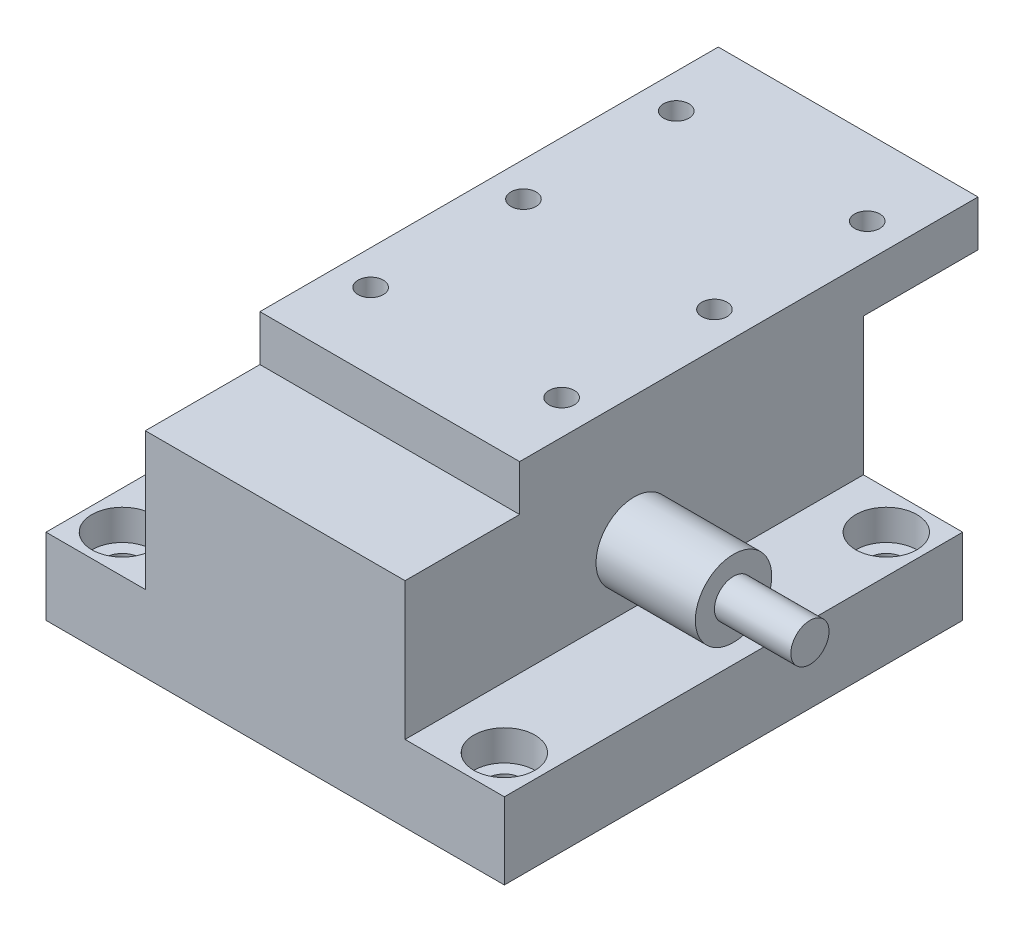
ISO-10303-21;
HEADER;
FILE_DESCRIPTION(('STEP AP214'),'2;1');
FILE_NAME('part.step','',(''),(''),'','','');
FILE_SCHEMA(('AUTOMOTIVE_DESIGN { 1 0 10303 214 1 1 1 1 }'));
ENDSEC;
DATA;
#1=APPLICATION_CONTEXT('core data for automotive mechanical design processes');
#2=APPLICATION_PROTOCOL_DEFINITION('international standard','automotive_design',2000,#1);
#3=PRODUCT_CONTEXT('',#1,'mechanical');
#4=PRODUCT('Part','Part','',(#3));
#5=PRODUCT_RELATED_PRODUCT_CATEGORY('part','',(#4));
#6=PRODUCT_DEFINITION_FORMATION('','',#4);
#7=PRODUCT_DEFINITION_CONTEXT('part definition',#1,'design');
#8=PRODUCT_DEFINITION('design','',#6,#7);
#9=PRODUCT_DEFINITION_SHAPE('','',#8);
#10=(LENGTH_UNIT() NAMED_UNIT(*) SI_UNIT(.MILLI.,.METRE.));
#11=(NAMED_UNIT(*) PLANE_ANGLE_UNIT() SI_UNIT($,.RADIAN.));
#12=(NAMED_UNIT(*) SI_UNIT($,.STERADIAN.) SOLID_ANGLE_UNIT());
#13=UNCERTAINTY_MEASURE_WITH_UNIT(LENGTH_MEASURE(1.E-05),#10,'distance_accuracy_value','');
#14=(GEOMETRIC_REPRESENTATION_CONTEXT(3) GLOBAL_UNCERTAINTY_ASSIGNED_CONTEXT((#13)) GLOBAL_UNIT_ASSIGNED_CONTEXT((#10,
#11,#12)) REPRESENTATION_CONTEXT('',''));
#15=CARTESIAN_POINT('',(0.,0.,0.));
#16=DIRECTION('',(0.,0.,1.));
#17=DIRECTION('',(1.,0.,0.));
#18=AXIS2_PLACEMENT_3D('',#15,#16,#17);
#19=CARTESIAN_POINT('',(30.,17.5,-30.));
#20=DIRECTION('',(1.,0.,0.));
#21=DIRECTION('',(0.,0.,-1.));
#22=AXIS2_PLACEMENT_3D('',#19,#20,#21);
#23=PLANE('',#22);
#24=CARTESIAN_POINT('',(30.,17.5,-30.));
#25=DIRECTION('',(1.,0.,0.));
#26=DIRECTION('',(0.,0.,-1.));
#27=AXIS2_PLACEMENT_3D('',#24,#25,#26);
#28=CIRCLE('',#27,5.);
#29=CARTESIAN_POINT('',(30.,17.5,-25.));
#30=VERTEX_POINT('',#29);
#31=EDGE_CURVE('E242',#30,#30,#28,.T.);
#32=ORIENTED_EDGE('',*,*,#31,.T.);
#33=EDGE_LOOP('',(#32));
#34=FACE_BOUND('',#33,.T.);
#35=CARTESIAN_POINT('',(30.,17.5,-30.));
#36=DIRECTION('',(1.,0.,0.));
#37=DIRECTION('',(0.,0.,-1.));
#38=AXIS2_PLACEMENT_3D('',#35,#36,#37);
#39=CIRCLE('',#38,2.5);
#40=CARTESIAN_POINT('',(30.,17.5,-32.5));
#41=VERTEX_POINT('',#40);
#42=EDGE_CURVE('E799',#41,#41,#39,.T.);
#43=ORIENTED_EDGE('',*,*,#42,.F.);
#44=EDGE_LOOP('',(#43));
#45=FACE_BOUND('',#44,.T.);
#46=ADVANCED_FACE('F34',(#34,#45),#23,.T.);
#47=CARTESIAN_POINT('',(0.,28.,0.));
#48=DIRECTION('',(0.,-1.,0.));
#49=DIRECTION('',(0.,0.,-1.));
#50=AXIS2_PLACEMENT_3D('',#47,#48,#49);
#51=PLANE('',#50);
#52=DIRECTION('',(1.,0.,0.));
#53=VECTOR('',#52,1.);
#54=CARTESIAN_POINT('',(-17.,28.,-15.));
#55=LINE('',#54,#53);
#56=CARTESIAN_POINT('',(-17.,28.,-15.));
#57=VERTEX_POINT('',#56);
#58=CARTESIAN_POINT('',(17.,28.,-15.));
#59=VERTEX_POINT('',#58);
#60=EDGE_CURVE('E51',#57,#59,#55,.T.);
#61=ORIENTED_EDGE('',*,*,#60,.F.);
#62=DIRECTION('',(0.,0.,1.));
#63=VECTOR('',#62,1.);
#64=CARTESIAN_POINT('',(-17.,28.,0.));
#65=LINE('',#64,#63);
#66=CARTESIAN_POINT('',(-17.,28.,0.));
#67=VERTEX_POINT('',#66);
#68=EDGE_CURVE('E250',#57,#67,#65,.T.);
#69=ORIENTED_EDGE('',*,*,#68,.T.);
#70=DIRECTION('',(1.,0.,0.));
#71=VECTOR('',#70,1.);
#72=CARTESIAN_POINT('',(-17.,28.,0.));
#73=LINE('',#72,#71);
#74=CARTESIAN_POINT('',(17.,28.,0.));
#75=VERTEX_POINT('',#74);
#76=EDGE_CURVE('E252',#67,#75,#73,.T.);
#77=ORIENTED_EDGE('',*,*,#76,.T.);
#78=DIRECTION('',(0.,0.,-1.));
#79=VECTOR('',#78,1.);
#80=CARTESIAN_POINT('',(17.,28.,0.));
#81=LINE('',#80,#79);
#82=EDGE_CURVE('E228',#75,#59,#81,.T.);
#83=ORIENTED_EDGE('',*,*,#82,.T.);
#84=EDGE_LOOP('',(#61,#69,#77,#83));
#85=FACE_BOUND('',#84,.T.);
#86=ADVANCED_FACE('F258',(#85),#51,.F.);
#87=CARTESIAN_POINT('',(17.,28.,0.));
#88=DIRECTION('',(-1.,0.,0.));
#89=DIRECTION('',(0.,0.,1.));
#90=AXIS2_PLACEMENT_3D('',#87,#88,#89);
#91=PLANE('',#90);
#92=DIRECTION('',(0.,0.,-1.));
#93=VECTOR('',#92,1.);
#94=CARTESIAN_POINT('',(17.,10.,0.));
#95=LINE('',#94,#93);
#96=CARTESIAN_POINT('',(17.,10.,0.));
#97=VERTEX_POINT('',#96);
#98=CARTESIAN_POINT('',(17.,10.,-60.));
#99=VERTEX_POINT('',#98);
#100=EDGE_CURVE('E241',#97,#99,#95,.T.);
#101=ORIENTED_EDGE('',*,*,#100,.T.);
#102=DIRECTION('',(0.,-1.,0.));
#103=VECTOR('',#102,1.);
#104=CARTESIAN_POINT('',(17.,28.,-60.));
#105=LINE('',#104,#103);
#106=CARTESIAN_POINT('',(17.,28.,-60.));
#107=VERTEX_POINT('',#106);
#108=EDGE_CURVE('E247',#107,#99,#105,.T.);
#109=ORIENTED_EDGE('',*,*,#108,.F.);
#110=DIRECTION('',(0.,0.,-1.));
#111=VECTOR('',#110,1.);
#112=CARTESIAN_POINT('',(17.,28.,-15.));
#113=LINE('',#112,#111);
#114=CARTESIAN_POINT('',(17.,28.,-75.));
#115=VERTEX_POINT('',#114);
#116=EDGE_CURVE('E192',#107,#115,#113,.T.);
#117=ORIENTED_EDGE('',*,*,#116,.T.);
#118=DIRECTION('',(0.,-1.,0.));
#119=VECTOR('',#118,1.);
#120=CARTESIAN_POINT('',(17.,34.,-75.));
#121=LINE('',#120,#119);
#122=CARTESIAN_POINT('',(17.,34.,-75.));
#123=VERTEX_POINT('',#122);
#124=EDGE_CURVE('E190',#123,#115,#121,.T.);
#125=ORIENTED_EDGE('',*,*,#124,.F.);
#126=DIRECTION('',(0.,0.,-1.));
#127=VECTOR('',#126,1.);
#128=CARTESIAN_POINT('',(17.,34.,-15.));
#129=LINE('',#128,#127);
#130=CARTESIAN_POINT('',(17.,34.,-15.));
#131=VERTEX_POINT('',#130);
#132=EDGE_CURVE('E177',#131,#123,#129,.T.);
#133=ORIENTED_EDGE('',*,*,#132,.F.);
#134=DIRECTION('',(0.,-1.,0.));
#135=VECTOR('',#134,1.);
#136=CARTESIAN_POINT('',(17.,34.,-15.));
#137=LINE('',#136,#135);
#138=EDGE_CURVE('E204',#131,#59,#137,.T.);
#139=ORIENTED_EDGE('',*,*,#138,.T.);
#140=ORIENTED_EDGE('',*,*,#82,.F.);
#141=DIRECTION('',(0.,-1.,0.));
#142=VECTOR('',#141,1.);
#143=CARTESIAN_POINT('',(17.,28.,0.));
#144=LINE('',#143,#142);
#145=EDGE_CURVE('E270',#75,#97,#144,.T.);
#146=ORIENTED_EDGE('',*,*,#145,.T.);
#147=EDGE_LOOP('',(#101,#109,#117,#125,#133,#139,#140,#146));
#148=FACE_BOUND('',#147,.T.);
#149=CARTESIAN_POINT('',(17.,17.5,-30.));
#150=DIRECTION('',(-1.,0.,0.));
#151=DIRECTION('',(0.,0.,1.));
#152=AXIS2_PLACEMENT_3D('',#149,#150,#151);
#153=CIRCLE('',#152,5.);
#154=CARTESIAN_POINT('',(17.,17.5,-25.));
#155=VERTEX_POINT('',#154);
#156=EDGE_CURVE('E11',#155,#155,#153,.F.);
#157=ORIENTED_EDGE('',*,*,#156,.F.);
#158=EDGE_LOOP('',(#157));
#159=FACE_BOUND('',#158,.T.);
#160=ADVANCED_FACE('F340',(#148,#159),#91,.F.);
#161=CARTESIAN_POINT('',(30.,10.,0.));
#162=DIRECTION('',(0.,-1.,0.));
#163=DIRECTION('',(0.,0.,-1.));
#164=AXIS2_PLACEMENT_3D('',#161,#162,#163);
#165=PLANE('',#164);
#166=CARTESIAN_POINT('',(-25.,10.,-55.));
#167=DIRECTION('',(0.,1.,0.));
#168=DIRECTION('',(0.,0.,1.));
#169=AXIS2_PLACEMENT_3D('',#166,#167,#168);
#170=CIRCLE('',#169,3.99999999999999);
#171=CARTESIAN_POINT('',(-25.,10.,-51.));
#172=VERTEX_POINT('',#171);
#173=EDGE_CURVE('E194',#172,#172,#170,.T.);
#174=ORIENTED_EDGE('',*,*,#173,.F.);
#175=EDGE_LOOP('',(#174));
#176=FACE_BOUND('',#175,.T.);
#177=CARTESIAN_POINT('',(-25.,10.,-5.));
#178=DIRECTION('',(0.,1.,0.));
#179=DIRECTION('',(0.,0.,1.));
#180=AXIS2_PLACEMENT_3D('',#177,#178,#179);
#181=CIRCLE('',#180,3.99999999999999);
#182=CARTESIAN_POINT('',(-25.,10.,-1.00000000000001));
#183=VERTEX_POINT('',#182);
#184=EDGE_CURVE('E437',#183,#183,#181,.T.);
#185=ORIENTED_EDGE('',*,*,#184,.F.);
#186=EDGE_LOOP('',(#185));
#187=FACE_BOUND('',#186,.T.);
#188=DIRECTION('',(0.,0.,1.));
#189=VECTOR('',#188,1.);
#190=CARTESIAN_POINT('',(-17.,10.,0.));
#191=LINE('',#190,#189);
#192=CARTESIAN_POINT('',(-17.,10.,-60.));
#193=VERTEX_POINT('',#192);
#194=CARTESIAN_POINT('',(-17.,10.,0.));
#195=VERTEX_POINT('',#194);
#196=EDGE_CURVE('E59',#193,#195,#191,.T.);
#197=ORIENTED_EDGE('',*,*,#196,.F.);
#198=DIRECTION('',(-1.,0.,0.));
#199=VECTOR('',#198,1.);
#200=CARTESIAN_POINT('',(30.,10.,-60.));
#201=LINE('',#200,#199);
#202=CARTESIAN_POINT('',(-30.,10.,-60.));
#203=VERTEX_POINT('',#202);
#204=EDGE_CURVE('E285',#193,#203,#201,.T.);
#205=ORIENTED_EDGE('',*,*,#204,.T.);
#206=DIRECTION('',(0.,0.,1.));
#207=VECTOR('',#206,1.);
#208=CARTESIAN_POINT('',(-30.,10.,0.));
#209=LINE('',#208,#207);
#210=CARTESIAN_POINT('',(-30.,10.,0.));
#211=VERTEX_POINT('',#210);
#212=EDGE_CURVE('E318',#203,#211,#209,.T.);
#213=ORIENTED_EDGE('',*,*,#212,.T.);
#214=DIRECTION('',(-1.,0.,0.));
#215=VECTOR('',#214,1.);
#216=CARTESIAN_POINT('',(30.,10.,0.));
#217=LINE('',#216,#215);
#218=EDGE_CURVE('E301',#195,#211,#217,.T.);
#219=ORIENTED_EDGE('',*,*,#218,.F.);
#220=EDGE_LOOP('',(#197,#205,#213,#219));
#221=FACE_BOUND('',#220,.T.);
#222=ADVANCED_FACE('F378',(#176,#187,#221),#165,.F.);
#223=CARTESIAN_POINT('',(25.,10.,-5.));
#224=DIRECTION('',(0.,1.,0.));
#225=DIRECTION('',(0.,0.,1.));
#226=AXIS2_PLACEMENT_3D('',#223,#224,#225);
#227=CIRCLE('',#226,3.99999999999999);
#228=CARTESIAN_POINT('',(25.,10.,-1.00000000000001));
#229=VERTEX_POINT('',#228);
#230=EDGE_CURVE('E427',#229,#229,#227,.T.);
#231=ORIENTED_EDGE('',*,*,#230,.F.);
#232=EDGE_LOOP('',(#231));
#233=FACE_BOUND('',#232,.T.);
#234=CARTESIAN_POINT('',(25.,10.,-55.));
#235=DIRECTION('',(0.,1.,0.));
#236=DIRECTION('',(0.,0.,1.));
#237=AXIS2_PLACEMENT_3D('',#234,#235,#236);
#238=CIRCLE('',#237,3.99999999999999);
#239=CARTESIAN_POINT('',(25.,10.,-51.));
#240=VERTEX_POINT('',#239);
#241=EDGE_CURVE('E417',#240,#240,#238,.T.);
#242=ORIENTED_EDGE('',*,*,#241,.F.);
#243=EDGE_LOOP('',(#242));
#244=FACE_BOUND('',#243,.T.);
#245=ORIENTED_EDGE('',*,*,#100,.F.);
#246=CARTESIAN_POINT('',(30.,10.,0.));
#247=VERTEX_POINT('',#246);
#248=EDGE_CURVE('E273',#247,#97,#217,.T.);
#249=ORIENTED_EDGE('',*,*,#248,.F.);
#250=DIRECTION('',(0.,0.,1.));
#251=VECTOR('',#250,1.);
#252=CARTESIAN_POINT('',(30.,10.,0.));
#253=LINE('',#252,#251);
#254=CARTESIAN_POINT('',(30.,10.,-60.));
#255=VERTEX_POINT('',#254);
#256=EDGE_CURVE('E302',#255,#247,#253,.T.);
#257=ORIENTED_EDGE('',*,*,#256,.F.);
#258=EDGE_CURVE('E288',#255,#99,#201,.T.);
#259=ORIENTED_EDGE('',*,*,#258,.T.);
#260=EDGE_LOOP('',(#245,#249,#257,#259));
#261=FACE_BOUND('',#260,.T.);
#262=ADVANCED_FACE('F334',(#233,#244,#261),#165,.F.);
#263=CARTESIAN_POINT('',(30.,0.,0.));
#264=DIRECTION('',(0.,0.,-1.));
#265=DIRECTION('',(-1.,0.,0.));
#266=AXIS2_PLACEMENT_3D('',#263,#264,#265);
#267=PLANE('',#266);
#268=DIRECTION('',(0.,-1.,0.));
#269=VECTOR('',#268,1.);
#270=CARTESIAN_POINT('',(-30.,0.,0.));
#271=LINE('',#270,#269);
#272=CARTESIAN_POINT('',(-30.,0.,0.));
#273=VERTEX_POINT('',#272);
#274=EDGE_CURVE('E276',#211,#273,#271,.T.);
#275=ORIENTED_EDGE('',*,*,#274,.T.);
#276=DIRECTION('',(-1.,0.,0.));
#277=VECTOR('',#276,1.);
#278=CARTESIAN_POINT('',(30.,0.,0.));
#279=LINE('',#278,#277);
#280=CARTESIAN_POINT('',(30.,0.,0.));
#281=VERTEX_POINT('',#280);
#282=EDGE_CURVE('E43',#281,#273,#279,.T.);
#283=ORIENTED_EDGE('',*,*,#282,.F.);
#284=DIRECTION('',(0.,-1.,0.));
#285=VECTOR('',#284,1.);
#286=CARTESIAN_POINT('',(30.,0.,0.));
#287=LINE('',#286,#285);
#288=EDGE_CURVE('E319',#247,#281,#287,.T.);
#289=ORIENTED_EDGE('',*,*,#288,.F.);
#290=ORIENTED_EDGE('',*,*,#248,.T.);
#291=ORIENTED_EDGE('',*,*,#145,.F.);
#292=ORIENTED_EDGE('',*,*,#76,.F.);
#293=DIRECTION('',(0.,-1.,0.));
#294=VECTOR('',#293,1.);
#295=CARTESIAN_POINT('',(-17.,28.,0.));
#296=LINE('',#295,#294);
#297=EDGE_CURVE('E266',#67,#195,#296,.T.);
#298=ORIENTED_EDGE('',*,*,#297,.T.);
#299=ORIENTED_EDGE('',*,*,#218,.T.);
#300=EDGE_LOOP('',(#275,#283,#289,#290,#291,#292,#298,#299));
#301=FACE_BOUND('',#300,.T.);
#302=ADVANCED_FACE('F36',(#301),#267,.F.);
#303=CARTESIAN_POINT('',(30.,0.,0.));
#304=DIRECTION('',(0.,1.,0.));
#305=DIRECTION('',(0.,0.,1.));
#306=AXIS2_PLACEMENT_3D('',#303,#304,#305);
#307=PLANE('',#306);
#308=CARTESIAN_POINT('',(-25.,0.,-55.));
#309=DIRECTION('',(0.,1.,0.));
#310=DIRECTION('',(0.,0.,1.));
#311=AXIS2_PLACEMENT_3D('',#308,#309,#310);
#312=CIRCLE('',#311,2.25);
#313=CARTESIAN_POINT('',(-25.,0.,-52.75));
#314=VERTEX_POINT('',#313);
#315=EDGE_CURVE('E397',#314,#314,#312,.T.);
#316=ORIENTED_EDGE('',*,*,#315,.T.);
#317=EDGE_LOOP('',(#316));
#318=FACE_BOUND('',#317,.T.);
#319=CARTESIAN_POINT('',(-25.,0.,-5.));
#320=DIRECTION('',(0.,1.,0.));
#321=DIRECTION('',(0.,0.,1.));
#322=AXIS2_PLACEMENT_3D('',#319,#320,#321);
#323=CIRCLE('',#322,2.25);
#324=CARTESIAN_POINT('',(-25.,0.,-2.75));
#325=VERTEX_POINT('',#324);
#326=EDGE_CURVE('E401',#325,#325,#323,.T.);
#327=ORIENTED_EDGE('',*,*,#326,.T.);
#328=EDGE_LOOP('',(#327));
#329=FACE_BOUND('',#328,.T.);
#330=CARTESIAN_POINT('',(25.,0.,-5.));
#331=DIRECTION('',(0.,1.,0.));
#332=DIRECTION('',(0.,0.,1.));
#333=AXIS2_PLACEMENT_3D('',#330,#331,#332);
#334=CIRCLE('',#333,2.25);
#335=CARTESIAN_POINT('',(25.,0.,-2.75));
#336=VERTEX_POINT('',#335);
#337=EDGE_CURVE('E405',#336,#336,#334,.T.);
#338=ORIENTED_EDGE('',*,*,#337,.T.);
#339=EDGE_LOOP('',(#338));
#340=FACE_BOUND('',#339,.T.);
#341=CARTESIAN_POINT('',(25.,0.,-55.));
#342=DIRECTION('',(0.,1.,0.));
#343=DIRECTION('',(0.,0.,1.));
#344=AXIS2_PLACEMENT_3D('',#341,#342,#343);
#345=CIRCLE('',#344,2.25);
#346=CARTESIAN_POINT('',(25.,0.,-52.75));
#347=VERTEX_POINT('',#346);
#348=EDGE_CURVE('E408',#347,#347,#345,.T.);
#349=ORIENTED_EDGE('',*,*,#348,.T.);
#350=EDGE_LOOP('',(#349));
#351=FACE_BOUND('',#350,.T.);
#352=DIRECTION('',(0.,0.,-1.));
#353=VECTOR('',#352,1.);
#354=CARTESIAN_POINT('',(-30.,0.,0.));
#355=LINE('',#354,#353);
#356=CARTESIAN_POINT('',(-30.,0.,-60.));
#357=VERTEX_POINT('',#356);
#358=EDGE_CURVE('E314',#273,#357,#355,.T.);
#359=ORIENTED_EDGE('',*,*,#358,.T.);
#360=DIRECTION('',(-1.,0.,0.));
#361=VECTOR('',#360,1.);
#362=CARTESIAN_POINT('',(30.,0.,-60.));
#363=LINE('',#362,#361);
#364=CARTESIAN_POINT('',(30.,0.,-60.));
#365=VERTEX_POINT('',#364);
#366=EDGE_CURVE('E295',#365,#357,#363,.T.);
#367=ORIENTED_EDGE('',*,*,#366,.F.);
#368=DIRECTION('',(0.,0.,-1.));
#369=VECTOR('',#368,1.);
#370=CARTESIAN_POINT('',(30.,0.,0.));
#371=LINE('',#370,#369);
#372=EDGE_CURVE('E309',#281,#365,#371,.T.);
#373=ORIENTED_EDGE('',*,*,#372,.F.);
#374=ORIENTED_EDGE('',*,*,#282,.T.);
#375=EDGE_LOOP('',(#359,#367,#373,#374));
#376=FACE_BOUND('',#375,.T.);
#377=ADVANCED_FACE('F328',(#318,#329,#340,#351,#376),#307,.F.);
#378=CARTESIAN_POINT('',(30.,0.,-60.));
#379=DIRECTION('',(0.,0.,1.));
#380=DIRECTION('',(1.,0.,0.));
#381=AXIS2_PLACEMENT_3D('',#378,#379,#380);
#382=PLANE('',#381);
#383=DIRECTION('',(0.,1.,0.));
#384=VECTOR('',#383,1.);
#385=CARTESIAN_POINT('',(-30.,0.,-60.));
#386=LINE('',#385,#384);
#387=EDGE_CURVE('E316',#357,#203,#386,.T.);
#388=ORIENTED_EDGE('',*,*,#387,.T.);
#389=ORIENTED_EDGE('',*,*,#204,.F.);
#390=DIRECTION('',(0.,-1.,0.));
#391=VECTOR('',#390,1.);
#392=CARTESIAN_POINT('',(-17.,28.,-60.));
#393=LINE('',#392,#391);
#394=CARTESIAN_POINT('',(-17.,28.,-60.));
#395=VERTEX_POINT('',#394);
#396=EDGE_CURVE('E227',#395,#193,#393,.T.);
#397=ORIENTED_EDGE('',*,*,#396,.F.);
#398=DIRECTION('',(-1.,0.,0.));
#399=VECTOR('',#398,1.);
#400=CARTESIAN_POINT('',(-17.,28.,-60.));
#401=LINE('',#400,#399);
#402=EDGE_CURVE('E224',#107,#395,#401,.T.);
#403=ORIENTED_EDGE('',*,*,#402,.F.);
#404=ORIENTED_EDGE('',*,*,#108,.T.);
#405=ORIENTED_EDGE('',*,*,#258,.F.);
#406=DIRECTION('',(0.,1.,0.));
#407=VECTOR('',#406,1.);
#408=CARTESIAN_POINT('',(30.,0.,-60.));
#409=LINE('',#408,#407);
#410=EDGE_CURVE('E304',#365,#255,#409,.T.);
#411=ORIENTED_EDGE('',*,*,#410,.F.);
#412=ORIENTED_EDGE('',*,*,#366,.T.);
#413=EDGE_LOOP('',(#388,#389,#397,#403,#404,#405,#411,#412));
#414=FACE_BOUND('',#413,.T.);
#415=ADVANCED_FACE('F331',(#414),#382,.F.);
#416=CARTESIAN_POINT('',(30.,0.,0.));
#417=DIRECTION('',(-1.,0.,0.));
#418=DIRECTION('',(0.,0.,1.));
#419=AXIS2_PLACEMENT_3D('',#416,#417,#418);
#420=PLANE('',#419);
#421=ORIENTED_EDGE('',*,*,#288,.T.);
#422=ORIENTED_EDGE('',*,*,#372,.T.);
#423=ORIENTED_EDGE('',*,*,#410,.T.);
#424=ORIENTED_EDGE('',*,*,#256,.T.);
#425=EDGE_LOOP('',(#421,#422,#423,#424));
#426=FACE_BOUND('',#425,.T.);
#427=ADVANCED_FACE('F324',(#426),#420,.F.);
#428=CARTESIAN_POINT('',(-30.,0.,0.));
#429=DIRECTION('',(-1.,0.,0.));
#430=DIRECTION('',(0.,0.,1.));
#431=AXIS2_PLACEMENT_3D('',#428,#429,#430);
#432=PLANE('',#431);
#433=ORIENTED_EDGE('',*,*,#274,.F.);
#434=ORIENTED_EDGE('',*,*,#212,.F.);
#435=ORIENTED_EDGE('',*,*,#387,.F.);
#436=ORIENTED_EDGE('',*,*,#358,.F.);
#437=EDGE_LOOP('',(#433,#434,#435,#436));
#438=FACE_BOUND('',#437,.T.);
#439=ADVANCED_FACE('F336',(#438),#432,.T.);
#440=CARTESIAN_POINT('',(-17.,28.,0.));
#441=DIRECTION('',(1.,0.,0.));
#442=DIRECTION('',(0.,0.,-1.));
#443=AXIS2_PLACEMENT_3D('',#440,#441,#442);
#444=PLANE('',#443);
#445=ORIENTED_EDGE('',*,*,#196,.T.);
#446=ORIENTED_EDGE('',*,*,#297,.F.);
#447=ORIENTED_EDGE('',*,*,#68,.F.);
#448=DIRECTION('',(0.,-1.,0.));
#449=VECTOR('',#448,1.);
#450=CARTESIAN_POINT('',(-17.,34.,-15.));
#451=LINE('',#450,#449);
#452=CARTESIAN_POINT('',(-17.,34.,-15.));
#453=VERTEX_POINT('',#452);
#454=EDGE_CURVE('E210',#453,#57,#451,.T.);
#455=ORIENTED_EDGE('',*,*,#454,.F.);
#456=DIRECTION('',(0.,0.,1.));
#457=VECTOR('',#456,1.);
#458=CARTESIAN_POINT('',(-17.,34.,-15.));
#459=LINE('',#458,#457);
#460=CARTESIAN_POINT('',(-17.,34.,-75.));
#461=VERTEX_POINT('',#460);
#462=EDGE_CURVE('E171',#461,#453,#459,.T.);
#463=ORIENTED_EDGE('',*,*,#462,.F.);
#464=DIRECTION('',(0.,-1.,0.));
#465=VECTOR('',#464,1.);
#466=CARTESIAN_POINT('',(-17.,34.,-75.));
#467=LINE('',#466,#465);
#468=CARTESIAN_POINT('',(-17.,28.,-75.));
#469=VERTEX_POINT('',#468);
#470=EDGE_CURVE('E181',#461,#469,#467,.T.);
#471=ORIENTED_EDGE('',*,*,#470,.T.);
#472=DIRECTION('',(0.,0.,1.));
#473=VECTOR('',#472,1.);
#474=CARTESIAN_POINT('',(-17.,28.,-15.));
#475=LINE('',#474,#473);
#476=EDGE_CURVE('E170',#469,#395,#475,.T.);
#477=ORIENTED_EDGE('',*,*,#476,.T.);
#478=ORIENTED_EDGE('',*,*,#396,.T.);
#479=EDGE_LOOP('',(#445,#446,#447,#455,#463,#471,#477,#478));
#480=FACE_BOUND('',#479,.T.);
#481=ADVANCED_FACE('F263',(#480),#444,.F.);
#482=CARTESIAN_POINT('',(30.,17.5,-30.));
#483=DIRECTION('',(-1.,0.,0.));
#484=DIRECTION('',(0.,0.,1.));
#485=AXIS2_PLACEMENT_3D('',#482,#483,#484);
#486=CYLINDRICAL_SURFACE('',#485,5.);
#487=CARTESIAN_POINT('',(30.,17.5,-25.));
#488=CARTESIAN_POINT('',(29.8645833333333,17.5,-25.));
#489=CARTESIAN_POINT('',(29.7291666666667,17.5,-25.));
#490=CARTESIAN_POINT('',(29.4583333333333,17.5,-25.));
#491=CARTESIAN_POINT('',(29.3229166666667,17.5,-25.));
#492=CARTESIAN_POINT('',(29.0520833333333,17.5,-25.));
#493=CARTESIAN_POINT('',(28.9166666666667,17.5,-25.));
#494=CARTESIAN_POINT('',(28.6458333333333,17.5,-25.));
#495=CARTESIAN_POINT('',(28.5104166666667,17.5,-25.));
#496=CARTESIAN_POINT('',(28.2395833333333,17.5,-25.));
#497=CARTESIAN_POINT('',(28.1041666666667,17.5,-25.));
#498=CARTESIAN_POINT('',(27.8333333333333,17.5,-25.));
#499=CARTESIAN_POINT('',(27.6979166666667,17.5,-25.));
#500=CARTESIAN_POINT('',(27.4270833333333,17.5,-25.));
#501=CARTESIAN_POINT('',(27.2916666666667,17.5,-25.));
#502=CARTESIAN_POINT('',(27.0208333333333,17.5,-25.));
#503=CARTESIAN_POINT('',(26.8854166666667,17.5,-25.));
#504=CARTESIAN_POINT('',(26.6145833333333,17.5,-25.));
#505=CARTESIAN_POINT('',(26.4791666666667,17.5,-25.));
#506=CARTESIAN_POINT('',(26.2083333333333,17.5,-25.));
#507=CARTESIAN_POINT('',(26.0729166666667,17.5,-25.));
#508=CARTESIAN_POINT('',(25.8020833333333,17.5,-25.));
#509=CARTESIAN_POINT('',(25.6666666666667,17.5,-25.));
#510=CARTESIAN_POINT('',(25.3958333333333,17.5,-25.));
#511=CARTESIAN_POINT('',(25.2604166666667,17.5,-25.));
#512=CARTESIAN_POINT('',(24.9895833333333,17.5,-25.));
#513=CARTESIAN_POINT('',(24.8541666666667,17.5,-25.));
#514=CARTESIAN_POINT('',(24.5833333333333,17.5,-25.));
#515=CARTESIAN_POINT('',(24.4479166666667,17.5,-25.));
#516=CARTESIAN_POINT('',(24.1770833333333,17.5,-25.));
#517=CARTESIAN_POINT('',(24.0416666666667,17.5,-25.));
#518=CARTESIAN_POINT('',(23.7708333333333,17.5,-25.));
#519=CARTESIAN_POINT('',(23.6354166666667,17.5,-25.));
#520=CARTESIAN_POINT('',(23.3645833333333,17.5,-25.));
#521=CARTESIAN_POINT('',(23.2291666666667,17.5,-25.));
#522=CARTESIAN_POINT('',(22.9583333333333,17.5,-25.));
#523=CARTESIAN_POINT('',(22.8229166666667,17.5,-25.));
#524=CARTESIAN_POINT('',(22.5520833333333,17.5,-25.));
#525=CARTESIAN_POINT('',(22.4166666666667,17.5,-25.));
#526=CARTESIAN_POINT('',(22.1458333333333,17.5,-25.));
#527=CARTESIAN_POINT('',(22.0104166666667,17.5,-25.));
#528=CARTESIAN_POINT('',(21.7395833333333,17.5,-25.));
#529=CARTESIAN_POINT('',(21.6041666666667,17.5,-25.));
#530=CARTESIAN_POINT('',(21.3333333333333,17.5,-25.));
#531=CARTESIAN_POINT('',(21.1979166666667,17.5,-25.));
#532=CARTESIAN_POINT('',(20.9270833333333,17.5,-25.));
#533=CARTESIAN_POINT('',(20.7916666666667,17.5,-25.));
#534=CARTESIAN_POINT('',(20.5208333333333,17.5,-25.));
#535=CARTESIAN_POINT('',(20.3854166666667,17.5,-25.));
#536=CARTESIAN_POINT('',(20.1145833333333,17.5,-25.));
#537=CARTESIAN_POINT('',(19.9791666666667,17.5,-25.));
#538=CARTESIAN_POINT('',(19.7083333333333,17.5,-25.));
#539=CARTESIAN_POINT('',(19.5729166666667,17.5,-25.));
#540=CARTESIAN_POINT('',(19.3020833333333,17.5,-25.));
#541=CARTESIAN_POINT('',(19.1666666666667,17.5,-25.));
#542=CARTESIAN_POINT('',(18.8958333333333,17.5,-25.));
#543=CARTESIAN_POINT('',(18.7604166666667,17.5,-25.));
#544=CARTESIAN_POINT('',(18.4895833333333,17.5,-25.));
#545=CARTESIAN_POINT('',(18.3541666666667,17.5,-25.));
#546=CARTESIAN_POINT('',(18.0833333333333,17.5,-25.));
#547=CARTESIAN_POINT('',(17.9479166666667,17.5,-25.));
#548=CARTESIAN_POINT('',(17.6770833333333,17.5,-25.));
#549=CARTESIAN_POINT('',(17.5416666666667,17.5,-25.));
#550=CARTESIAN_POINT('',(17.2708333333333,17.5,-25.));
#551=CARTESIAN_POINT('',(17.1354166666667,17.5,-25.));
#552=CARTESIAN_POINT('',(17.,17.5,-25.));
#553=B_SPLINE_CURVE_WITH_KNOTS('',3,(#487,#488,#489,#490,#491,#492,#493,#494,#495,#496,#497,
#498,#499,#500,#501,#502,#503,#504,#505,#506,#507,#508,#509,#510,#511,#512,#513,#514,#515,#516,
#517,#518,#519,#520,#521,#522,#523,#524,#525,#526,#527,#528,#529,#530,#531,#532,#533,#534,#535,
#536,#537,#538,#539,#540,#541,#542,#543,#544,#545,#546,#547,#548,#549,#550,#551,#552),
.UNSPECIFIED.,.F.,.F.,(4,2,2,2,2,2,2,2,2,2,2,2,2,2,2,2,2,2,2,2,2,2,2,2,2,2,2,2,2,2,2,2,4),(0.,
0.40625,0.812500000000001,1.21875,1.625,2.03125,2.4375,2.84375,3.25,3.65625,4.0625,4.46875,
4.875,5.28125,5.6875,6.09375,6.5,6.90625,7.3125,7.71875,8.125,8.53125,8.9375,9.34375,
9.74999999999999,10.15625,10.5625,10.96875,11.375,11.78125,12.1875,12.59375,13.),.UNSPECIFIED.);
#554=EDGE_CURVE('BSEAM372',#30,#155,#553,.T.);
#555=ORIENTED_EDGE('',*,*,#31,.F.);
#556=ORIENTED_EDGE('',*,*,#156,.T.);
#557=ORIENTED_EDGE('',*,*,#554,.T.);
#558=ORIENTED_EDGE('',*,*,#554,.F.);
#559=EDGE_LOOP('',(#555,#557,#556,#558));
#560=FACE_BOUND('',#559,.T.);
#561=ADVANCED_FACE('F372',(#560),#486,.T.);
#562=CARTESIAN_POINT('',(25.,10.,-55.));
#563=DIRECTION('',(0.,1.,0.));
#564=DIRECTION('',(0.,0.,1.));
#565=AXIS2_PLACEMENT_3D('',#562,#563,#564);
#566=CYLINDRICAL_SURFACE('',#565,2.25);
#567=ORIENTED_EDGE('',*,*,#348,.F.);
#568=EDGE_LOOP('',(#567));
#569=FACE_BOUND('',#568,.T.);
#570=CARTESIAN_POINT('',(25.,6.,-55.));
#571=DIRECTION('',(0.,1.,0.));
#572=DIRECTION('',(0.,0.,1.));
#573=AXIS2_PLACEMENT_3D('',#570,#571,#572);
#574=CIRCLE('',#573,2.25);
#575=CARTESIAN_POINT('',(25.,6.,-52.75));
#576=VERTEX_POINT('',#575);
#577=EDGE_CURVE('E410',#576,#576,#574,.T.);
#578=ORIENTED_EDGE('',*,*,#577,.T.);
#579=EDGE_LOOP('',(#578));
#580=FACE_BOUND('',#579,.T.);
#581=ADVANCED_FACE('F370',(#569,#580),#566,.F.);
#582=CARTESIAN_POINT('',(27.25,6.,-55.));
#583=DIRECTION('',(0.,-1.,0.));
#584=DIRECTION('',(0.,0.,-1.));
#585=AXIS2_PLACEMENT_3D('',#582,#583,#584);
#586=PLANE('',#585);
#587=ORIENTED_EDGE('',*,*,#577,.F.);
#588=EDGE_LOOP('',(#587));
#589=FACE_BOUND('',#588,.T.);
#590=CARTESIAN_POINT('',(25.,6.,-55.));
#591=DIRECTION('',(0.,1.,0.));
#592=DIRECTION('',(0.,0.,1.));
#593=AXIS2_PLACEMENT_3D('',#590,#591,#592);
#594=CIRCLE('',#593,4.);
#595=CARTESIAN_POINT('',(25.,6.,-51.));
#596=VERTEX_POINT('',#595);
#597=EDGE_CURVE('E412',#596,#596,#594,.T.);
#598=ORIENTED_EDGE('',*,*,#597,.T.);
#599=EDGE_LOOP('',(#598));
#600=FACE_BOUND('',#599,.T.);
#601=ADVANCED_FACE('F490',(#589,#600),#586,.F.);
#602=CARTESIAN_POINT('',(25.,10.,-55.));
#603=DIRECTION('',(0.,1.,0.));
#604=DIRECTION('',(0.,0.,1.));
#605=AXIS2_PLACEMENT_3D('',#602,#603,#604);
#606=CYLINDRICAL_SURFACE('',#605,3.99999999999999);
#607=ORIENTED_EDGE('',*,*,#597,.F.);
#608=EDGE_LOOP('',(#607));
#609=FACE_BOUND('',#608,.T.);
#610=ORIENTED_EDGE('',*,*,#241,.T.);
#611=EDGE_LOOP('',(#610));
#612=FACE_BOUND('',#611,.T.);
#613=ADVANCED_FACE('F487',(#609,#612),#606,.F.);
#614=CARTESIAN_POINT('',(25.,10.,-5.));
#615=DIRECTION('',(0.,1.,0.));
#616=DIRECTION('',(0.,0.,1.));
#617=AXIS2_PLACEMENT_3D('',#614,#615,#616);
#618=CYLINDRICAL_SURFACE('',#617,2.25);
#619=ORIENTED_EDGE('',*,*,#337,.F.);
#620=EDGE_LOOP('',(#619));
#621=FACE_BOUND('',#620,.T.);
#622=CARTESIAN_POINT('',(25.,6.,-5.));
#623=DIRECTION('',(0.,1.,0.));
#624=DIRECTION('',(0.,0.,1.));
#625=AXIS2_PLACEMENT_3D('',#622,#623,#624);
#626=CIRCLE('',#625,2.25);
#627=CARTESIAN_POINT('',(25.,6.,-2.75));
#628=VERTEX_POINT('',#627);
#629=EDGE_CURVE('E421',#628,#628,#626,.T.);
#630=ORIENTED_EDGE('',*,*,#629,.T.);
#631=EDGE_LOOP('',(#630));
#632=FACE_BOUND('',#631,.T.);
#633=ADVANCED_FACE('F483',(#621,#632),#618,.F.);
#634=CARTESIAN_POINT('',(27.25,6.,-5.));
#635=DIRECTION('',(0.,-1.,0.));
#636=DIRECTION('',(0.,0.,-1.));
#637=AXIS2_PLACEMENT_3D('',#634,#635,#636);
#638=PLANE('',#637);
#639=ORIENTED_EDGE('',*,*,#629,.F.);
#640=EDGE_LOOP('',(#639));
#641=FACE_BOUND('',#640,.T.);
#642=CARTESIAN_POINT('',(25.,6.,-5.));
#643=DIRECTION('',(0.,1.,0.));
#644=DIRECTION('',(0.,0.,1.));
#645=AXIS2_PLACEMENT_3D('',#642,#643,#644);
#646=CIRCLE('',#645,4.);
#647=CARTESIAN_POINT('',(25.,6.,-1.));
#648=VERTEX_POINT('',#647);
#649=EDGE_CURVE('E424',#648,#648,#646,.T.);
#650=ORIENTED_EDGE('',*,*,#649,.T.);
#651=EDGE_LOOP('',(#650));
#652=FACE_BOUND('',#651,.T.);
#653=ADVANCED_FACE('F479',(#641,#652),#638,.F.);
#654=CARTESIAN_POINT('',(25.,10.,-5.));
#655=DIRECTION('',(0.,1.,0.));
#656=DIRECTION('',(0.,0.,1.));
#657=AXIS2_PLACEMENT_3D('',#654,#655,#656);
#658=CYLINDRICAL_SURFACE('',#657,3.99999999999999);
#659=ORIENTED_EDGE('',*,*,#649,.F.);
#660=EDGE_LOOP('',(#659));
#661=FACE_BOUND('',#660,.T.);
#662=ORIENTED_EDGE('',*,*,#230,.T.);
#663=EDGE_LOOP('',(#662));
#664=FACE_BOUND('',#663,.T.);
#665=ADVANCED_FACE('F475',(#661,#664),#658,.F.);
#666=CARTESIAN_POINT('',(-25.,10.,-5.));
#667=DIRECTION('',(0.,1.,0.));
#668=DIRECTION('',(0.,0.,1.));
#669=AXIS2_PLACEMENT_3D('',#666,#667,#668);
#670=CYLINDRICAL_SURFACE('',#669,2.25);
#671=ORIENTED_EDGE('',*,*,#326,.F.);
#672=EDGE_LOOP('',(#671));
#673=FACE_BOUND('',#672,.T.);
#674=CARTESIAN_POINT('',(-25.,6.,-5.));
#675=DIRECTION('',(0.,1.,0.));
#676=DIRECTION('',(0.,0.,1.));
#677=AXIS2_PLACEMENT_3D('',#674,#675,#676);
#678=CIRCLE('',#677,2.25);
#679=CARTESIAN_POINT('',(-25.,6.,-2.75));
#680=VERTEX_POINT('',#679);
#681=EDGE_CURVE('E431',#680,#680,#678,.T.);
#682=ORIENTED_EDGE('',*,*,#681,.T.);
#683=EDGE_LOOP('',(#682));
#684=FACE_BOUND('',#683,.T.);
#685=ADVANCED_FACE('F467',(#673,#684),#670,.F.);
#686=CARTESIAN_POINT('',(-22.75,6.,-5.));
#687=DIRECTION('',(0.,-1.,0.));
#688=DIRECTION('',(0.,0.,-1.));
#689=AXIS2_PLACEMENT_3D('',#686,#687,#688);
#690=PLANE('',#689);
#691=ORIENTED_EDGE('',*,*,#681,.F.);
#692=EDGE_LOOP('',(#691));
#693=FACE_BOUND('',#692,.T.);
#694=CARTESIAN_POINT('',(-25.,6.,-5.));
#695=DIRECTION('',(0.,1.,0.));
#696=DIRECTION('',(0.,0.,1.));
#697=AXIS2_PLACEMENT_3D('',#694,#695,#696);
#698=CIRCLE('',#697,4.);
#699=CARTESIAN_POINT('',(-25.,6.,-1.));
#700=VERTEX_POINT('',#699);
#701=EDGE_CURVE('E434',#700,#700,#698,.T.);
#702=ORIENTED_EDGE('',*,*,#701,.T.);
#703=EDGE_LOOP('',(#702));
#704=FACE_BOUND('',#703,.T.);
#705=ADVANCED_FACE('F457',(#693,#704),#690,.F.);
#706=CARTESIAN_POINT('',(-25.,10.,-5.));
#707=DIRECTION('',(0.,1.,0.));
#708=DIRECTION('',(0.,0.,1.));
#709=AXIS2_PLACEMENT_3D('',#706,#707,#708);
#710=CYLINDRICAL_SURFACE('',#709,3.99999999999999);
#711=ORIENTED_EDGE('',*,*,#701,.F.);
#712=EDGE_LOOP('',(#711));
#713=FACE_BOUND('',#712,.T.);
#714=ORIENTED_EDGE('',*,*,#184,.T.);
#715=EDGE_LOOP('',(#714));
#716=FACE_BOUND('',#715,.T.);
#717=ADVANCED_FACE('F454',(#713,#716),#710,.F.);
#718=CARTESIAN_POINT('',(-25.,10.,-55.));
#719=DIRECTION('',(0.,1.,0.));
#720=DIRECTION('',(0.,0.,1.));
#721=AXIS2_PLACEMENT_3D('',#718,#719,#720);
#722=CYLINDRICAL_SURFACE('',#721,2.25);
#723=ORIENTED_EDGE('',*,*,#315,.F.);
#724=EDGE_LOOP('',(#723));
#725=FACE_BOUND('',#724,.T.);
#726=CARTESIAN_POINT('',(-25.,6.,-55.));
#727=DIRECTION('',(0.,1.,0.));
#728=DIRECTION('',(0.,0.,1.));
#729=AXIS2_PLACEMENT_3D('',#726,#727,#728);
#730=CIRCLE('',#729,2.25);
#731=CARTESIAN_POINT('',(-25.,6.,-52.75));
#732=VERTEX_POINT('',#731);
#733=EDGE_CURVE('E441',#732,#732,#730,.T.);
#734=ORIENTED_EDGE('',*,*,#733,.T.);
#735=EDGE_LOOP('',(#734));
#736=FACE_BOUND('',#735,.T.);
#737=ADVANCED_FACE('F456',(#725,#736),#722,.F.);
#738=CARTESIAN_POINT('',(-22.75,6.,-55.));
#739=DIRECTION('',(0.,-1.,0.));
#740=DIRECTION('',(0.,0.,-1.));
#741=AXIS2_PLACEMENT_3D('',#738,#739,#740);
#742=PLANE('',#741);
#743=ORIENTED_EDGE('',*,*,#733,.F.);
#744=EDGE_LOOP('',(#743));
#745=FACE_BOUND('',#744,.T.);
#746=CARTESIAN_POINT('',(-25.,6.,-55.));
#747=DIRECTION('',(0.,1.,0.));
#748=DIRECTION('',(0.,0.,1.));
#749=AXIS2_PLACEMENT_3D('',#746,#747,#748);
#750=CIRCLE('',#749,4.);
#751=CARTESIAN_POINT('',(-25.,6.,-51.));
#752=VERTEX_POINT('',#751);
#753=EDGE_CURVE('E443',#752,#752,#750,.T.);
#754=ORIENTED_EDGE('',*,*,#753,.T.);
#755=EDGE_LOOP('',(#754));
#756=FACE_BOUND('',#755,.T.);
#757=ADVANCED_FACE('F464',(#745,#756),#742,.F.);
#758=CARTESIAN_POINT('',(-25.,10.,-55.));
#759=DIRECTION('',(0.,1.,0.));
#760=DIRECTION('',(0.,0.,1.));
#761=AXIS2_PLACEMENT_3D('',#758,#759,#760);
#762=CYLINDRICAL_SURFACE('',#761,3.99999999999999);
#763=ORIENTED_EDGE('',*,*,#753,.F.);
#764=EDGE_LOOP('',(#763));
#765=FACE_BOUND('',#764,.T.);
#766=ORIENTED_EDGE('',*,*,#173,.T.);
#767=EDGE_LOOP('',(#766));
#768=FACE_BOUND('',#767,.T.);
#769=ADVANCED_FACE('F450',(#765,#768),#762,.F.);
#770=CARTESIAN_POINT('',(-17.,34.,-15.));
#771=DIRECTION('',(0.,0.,-1.));
#772=DIRECTION('',(-1.,0.,0.));
#773=AXIS2_PLACEMENT_3D('',#770,#771,#772);
#774=PLANE('',#773);
#775=ORIENTED_EDGE('',*,*,#60,.T.);
#776=ORIENTED_EDGE('',*,*,#138,.F.);
#777=DIRECTION('',(1.,0.,0.));
#778=VECTOR('',#777,1.);
#779=CARTESIAN_POINT('',(-17.,34.,-15.));
#780=LINE('',#779,#778);
#781=EDGE_CURVE('E174',#453,#131,#780,.T.);
#782=ORIENTED_EDGE('',*,*,#781,.F.);
#783=ORIENTED_EDGE('',*,*,#454,.T.);
#784=EDGE_LOOP('',(#775,#776,#782,#783));
#785=FACE_BOUND('',#784,.T.);
#786=ADVANCED_FACE('F261',(#785),#774,.F.);
#787=CARTESIAN_POINT('',(-17.,34.,-75.));
#788=DIRECTION('',(0.,0.,1.));
#789=DIRECTION('',(1.,0.,0.));
#790=AXIS2_PLACEMENT_3D('',#787,#788,#789);
#791=PLANE('',#790);
#792=DIRECTION('',(-1.,0.,0.));
#793=VECTOR('',#792,1.);
#794=CARTESIAN_POINT('',(-17.,28.,-75.));
#795=LINE('',#794,#793);
#796=EDGE_CURVE('E175',#115,#469,#795,.T.);
#797=ORIENTED_EDGE('',*,*,#796,.T.);
#798=ORIENTED_EDGE('',*,*,#470,.F.);
#799=DIRECTION('',(-1.,0.,0.));
#800=VECTOR('',#799,1.);
#801=CARTESIAN_POINT('',(-17.,34.,-75.));
#802=LINE('',#801,#800);
#803=EDGE_CURVE('E179',#123,#461,#802,.T.);
#804=ORIENTED_EDGE('',*,*,#803,.F.);
#805=ORIENTED_EDGE('',*,*,#124,.T.);
#806=EDGE_LOOP('',(#797,#798,#804,#805));
#807=FACE_BOUND('',#806,.T.);
#808=ADVANCED_FACE('F342',(#807),#791,.F.);
#809=CARTESIAN_POINT('',(0.,34.,0.));
#810=DIRECTION('',(0.,-1.,0.));
#811=DIRECTION('',(0.,0.,-1.));
#812=AXIS2_PLACEMENT_3D('',#809,#810,#811);
#813=PLANE('',#812);
#814=CARTESIAN_POINT('',(-12.5,34.,-65.));
#815=DIRECTION('',(0.,1.,0.));
#816=DIRECTION('',(0.,0.,1.));
#817=AXIS2_PLACEMENT_3D('',#814,#815,#816);
#818=CIRCLE('',#817,1.64999999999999);
#819=CARTESIAN_POINT('',(-12.5,34.,-63.35));
#820=VERTEX_POINT('',#819);
#821=EDGE_CURVE('E798',#820,#820,#818,.T.);
#822=ORIENTED_EDGE('',*,*,#821,.F.);
#823=EDGE_LOOP('',(#822));
#824=FACE_BOUND('',#823,.T.);
#825=CARTESIAN_POINT('',(12.5,34.,-65.));
#826=DIRECTION('',(0.,1.,0.));
#827=DIRECTION('',(0.,0.,1.));
#828=AXIS2_PLACEMENT_3D('',#825,#826,#827);
#829=CIRCLE('',#828,1.64999999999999);
#830=CARTESIAN_POINT('',(12.5,34.,-63.35));
#831=VERTEX_POINT('',#830);
#832=EDGE_CURVE('E806',#831,#831,#829,.T.);
#833=ORIENTED_EDGE('',*,*,#832,.F.);
#834=EDGE_LOOP('',(#833));
#835=FACE_BOUND('',#834,.T.);
#836=CARTESIAN_POINT('',(12.5,34.,-45.));
#837=DIRECTION('',(0.,1.,0.));
#838=DIRECTION('',(0.,0.,1.));
#839=AXIS2_PLACEMENT_3D('',#836,#837,#838);
#840=CIRCLE('',#839,1.64999999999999);
#841=CARTESIAN_POINT('',(12.5,34.,-43.35));
#842=VERTEX_POINT('',#841);
#843=EDGE_CURVE('E146',#842,#842,#840,.T.);
#844=ORIENTED_EDGE('',*,*,#843,.F.);
#845=EDGE_LOOP('',(#844));
#846=FACE_BOUND('',#845,.T.);
#847=CARTESIAN_POINT('',(-12.5,34.,-45.));
#848=DIRECTION('',(0.,1.,0.));
#849=DIRECTION('',(0.,0.,1.));
#850=AXIS2_PLACEMENT_3D('',#847,#848,#849);
#851=CIRCLE('',#850,1.64999999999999);
#852=CARTESIAN_POINT('',(-12.5,34.,-43.35));
#853=VERTEX_POINT('',#852);
#854=EDGE_CURVE('E145',#853,#853,#851,.T.);
#855=ORIENTED_EDGE('',*,*,#854,.F.);
#856=EDGE_LOOP('',(#855));
#857=FACE_BOUND('',#856,.T.);
#858=CARTESIAN_POINT('',(-12.5,34.,-25.));
#859=DIRECTION('',(0.,1.,0.));
#860=DIRECTION('',(0.,0.,1.));
#861=AXIS2_PLACEMENT_3D('',#858,#859,#860);
#862=CIRCLE('',#861,1.64999999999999);
#863=CARTESIAN_POINT('',(-12.5,34.,-23.35));
#864=VERTEX_POINT('',#863);
#865=EDGE_CURVE('E158',#864,#864,#862,.T.);
#866=ORIENTED_EDGE('',*,*,#865,.F.);
#867=EDGE_LOOP('',(#866));
#868=FACE_BOUND('',#867,.T.);
#869=CARTESIAN_POINT('',(12.5,34.,-25.));
#870=DIRECTION('',(0.,1.,0.));
#871=DIRECTION('',(0.,0.,1.));
#872=AXIS2_PLACEMENT_3D('',#869,#870,#871);
#873=CIRCLE('',#872,1.64999999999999);
#874=CARTESIAN_POINT('',(12.5,34.,-23.35));
#875=VERTEX_POINT('',#874);
#876=EDGE_CURVE('E164',#875,#875,#873,.T.);
#877=ORIENTED_EDGE('',*,*,#876,.F.);
#878=EDGE_LOOP('',(#877));
#879=FACE_BOUND('',#878,.T.);
#880=ORIENTED_EDGE('',*,*,#462,.T.);
#881=ORIENTED_EDGE('',*,*,#781,.T.);
#882=ORIENTED_EDGE('',*,*,#132,.T.);
#883=ORIENTED_EDGE('',*,*,#803,.T.);
#884=EDGE_LOOP('',(#880,#881,#882,#883));
#885=FACE_BOUND('',#884,.T.);
#886=ADVANCED_FACE('F344',(#824,#835,#846,#857,#868,#879,#885),#813,.F.);
#887=CARTESIAN_POINT('',(0.,28.,0.));
#888=DIRECTION('',(0.,-1.,0.));
#889=DIRECTION('',(0.,0.,-1.));
#890=AXIS2_PLACEMENT_3D('',#887,#888,#889);
#891=PLANE('',#890);
#892=CARTESIAN_POINT('',(-12.5,28.,-65.));
#893=DIRECTION('',(0.,-1.,0.));
#894=DIRECTION('',(0.,0.,-1.));
#895=AXIS2_PLACEMENT_3D('',#892,#893,#894);
#896=CIRCLE('',#895,1.64999999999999);
#897=CARTESIAN_POINT('',(-12.5,28.,-66.65));
#898=VERTEX_POINT('',#897);
#899=EDGE_CURVE('E38',#898,#898,#896,.T.);
#900=ORIENTED_EDGE('',*,*,#899,.F.);
#901=EDGE_LOOP('',(#900));
#902=FACE_BOUND('',#901,.T.);
#903=CARTESIAN_POINT('',(12.5,28.,-65.));
#904=DIRECTION('',(0.,-1.,0.));
#905=DIRECTION('',(0.,0.,-1.));
#906=AXIS2_PLACEMENT_3D('',#903,#904,#905);
#907=CIRCLE('',#906,1.64999999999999);
#908=CARTESIAN_POINT('',(12.5,28.,-66.65));
#909=VERTEX_POINT('',#908);
#910=EDGE_CURVE('E152',#909,#909,#907,.T.);
#911=ORIENTED_EDGE('',*,*,#910,.F.);
#912=EDGE_LOOP('',(#911));
#913=FACE_BOUND('',#912,.T.);
#914=ORIENTED_EDGE('',*,*,#116,.F.);
#915=ORIENTED_EDGE('',*,*,#402,.T.);
#916=ORIENTED_EDGE('',*,*,#476,.F.);
#917=ORIENTED_EDGE('',*,*,#796,.F.);
#918=EDGE_LOOP('',(#914,#915,#916,#917));
#919=FACE_BOUND('',#918,.T.);
#920=ADVANCED_FACE('F339',(#902,#913,#919),#891,.T.);
#921=CARTESIAN_POINT('',(12.5,27.,-25.));
#922=DIRECTION('',(0.,1.,0.));
#923=DIRECTION('',(0.,0.,1.));
#924=AXIS2_PLACEMENT_3D('',#921,#922,#923);
#925=CONICAL_SURFACE('',#924,1.65,1.02974425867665);
#926=CARTESIAN_POINT('',(12.5,26.0085799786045,-25.));
#927=VERTEX_POINT('',#926);
#928=VERTEX_LOOP('',#927);
#929=FACE_BOUND('',#928,.T.);
#930=CARTESIAN_POINT('',(12.5,27.,-25.));
#931=DIRECTION('',(0.,1.,0.));
#932=DIRECTION('',(0.,0.,1.));
#933=AXIS2_PLACEMENT_3D('',#930,#931,#932);
#934=CIRCLE('',#933,1.65);
#935=CARTESIAN_POINT('',(12.5,27.,-23.35));
#936=VERTEX_POINT('',#935);
#937=EDGE_CURVE('E167',#936,#936,#934,.T.);
#938=ORIENTED_EDGE('',*,*,#937,.T.);
#939=EDGE_LOOP('',(#938));
#940=FACE_BOUND('',#939,.T.);
#941=ADVANCED_FACE('F352',(#929,#940),#925,.F.);
#942=CARTESIAN_POINT('',(12.5,34.,-25.));
#943=DIRECTION('',(0.,1.,0.));
#944=DIRECTION('',(0.,0.,1.));
#945=AXIS2_PLACEMENT_3D('',#942,#943,#944);
#946=CYLINDRICAL_SURFACE('',#945,1.64999999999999);
#947=ORIENTED_EDGE('',*,*,#937,.F.);
#948=EDGE_LOOP('',(#947));
#949=FACE_BOUND('',#948,.T.);
#950=ORIENTED_EDGE('',*,*,#876,.T.);
#951=EDGE_LOOP('',(#950));
#952=FACE_BOUND('',#951,.T.);
#953=ADVANCED_FACE('F679',(#949,#952),#946,.F.);
#954=CARTESIAN_POINT('',(-12.5,27.,-25.));
#955=DIRECTION('',(0.,1.,0.));
#956=DIRECTION('',(0.,0.,1.));
#957=AXIS2_PLACEMENT_3D('',#954,#955,#956);
#958=CONICAL_SURFACE('',#957,1.65,1.02974425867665);
#959=CARTESIAN_POINT('',(-12.5,26.0085799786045,-25.));
#960=VERTEX_POINT('',#959);
#961=VERTEX_LOOP('',#960);
#962=FACE_BOUND('',#961,.T.);
#963=CARTESIAN_POINT('',(-12.5,27.,-25.));
#964=DIRECTION('',(0.,1.,0.));
#965=DIRECTION('',(0.,0.,1.));
#966=AXIS2_PLACEMENT_3D('',#963,#964,#965);
#967=CIRCLE('',#966,1.65);
#968=CARTESIAN_POINT('',(-12.5,27.,-23.35));
#969=VERTEX_POINT('',#968);
#970=EDGE_CURVE('E161',#969,#969,#967,.T.);
#971=ORIENTED_EDGE('',*,*,#970,.T.);
#972=EDGE_LOOP('',(#971));
#973=FACE_BOUND('',#972,.T.);
#974=ADVANCED_FACE('F689',(#962,#973),#958,.F.);
#975=CARTESIAN_POINT('',(-12.5,34.,-25.));
#976=DIRECTION('',(0.,1.,0.));
#977=DIRECTION('',(0.,0.,1.));
#978=AXIS2_PLACEMENT_3D('',#975,#976,#977);
#979=CYLINDRICAL_SURFACE('',#978,1.64999999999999);
#980=ORIENTED_EDGE('',*,*,#970,.F.);
#981=EDGE_LOOP('',(#980));
#982=FACE_BOUND('',#981,.T.);
#983=ORIENTED_EDGE('',*,*,#865,.T.);
#984=EDGE_LOOP('',(#983));
#985=FACE_BOUND('',#984,.T.);
#986=ADVANCED_FACE('F700',(#982,#985),#979,.F.);
#987=CARTESIAN_POINT('',(-12.5,27.,-45.));
#988=DIRECTION('',(0.,1.,0.));
#989=DIRECTION('',(0.,0.,1.));
#990=AXIS2_PLACEMENT_3D('',#987,#988,#989);
#991=CONICAL_SURFACE('',#990,1.65,1.02974425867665);
#992=CARTESIAN_POINT('',(-12.5,26.0085799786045,-45.));
#993=VERTEX_POINT('',#992);
#994=VERTEX_LOOP('',#993);
#995=FACE_BOUND('',#994,.T.);
#996=CARTESIAN_POINT('',(-12.5,27.,-45.));
#997=DIRECTION('',(0.,1.,0.));
#998=DIRECTION('',(0.,0.,1.));
#999=AXIS2_PLACEMENT_3D('',#996,#997,#998);
#1000=CIRCLE('',#999,1.65);
#1001=CARTESIAN_POINT('',(-12.5,27.,-43.35));
#1002=VERTEX_POINT('',#1001);
#1003=EDGE_CURVE('E149',#1002,#1002,#1000,.T.);
#1004=ORIENTED_EDGE('',*,*,#1003,.T.);
#1005=EDGE_LOOP('',(#1004));
#1006=FACE_BOUND('',#1005,.T.);
#1007=ADVANCED_FACE('F710',(#995,#1006),#991,.F.);
#1008=CARTESIAN_POINT('',(-12.5,34.,-45.));
#1009=DIRECTION('',(0.,1.,0.));
#1010=DIRECTION('',(0.,0.,1.));
#1011=AXIS2_PLACEMENT_3D('',#1008,#1009,#1010);
#1012=CYLINDRICAL_SURFACE('',#1011,1.64999999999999);
#1013=ORIENTED_EDGE('',*,*,#1003,.F.);
#1014=EDGE_LOOP('',(#1013));
#1015=FACE_BOUND('',#1014,.T.);
#1016=ORIENTED_EDGE('',*,*,#854,.T.);
#1017=EDGE_LOOP('',(#1016));
#1018=FACE_BOUND('',#1017,.T.);
#1019=ADVANCED_FACE('F139',(#1015,#1018),#1012,.F.);
#1020=CARTESIAN_POINT('',(12.5,27.,-45.));
#1021=DIRECTION('',(0.,1.,0.));
#1022=DIRECTION('',(0.,0.,1.));
#1023=AXIS2_PLACEMENT_3D('',#1020,#1021,#1022);
#1024=CONICAL_SURFACE('',#1023,1.65,1.02974425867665);
#1025=CARTESIAN_POINT('',(12.5,26.0085799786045,-45.));
#1026=VERTEX_POINT('',#1025);
#1027=VERTEX_LOOP('',#1026);
#1028=FACE_BOUND('',#1027,.T.);
#1029=CARTESIAN_POINT('',(12.5,27.,-45.));
#1030=DIRECTION('',(0.,1.,0.));
#1031=DIRECTION('',(0.,0.,1.));
#1032=AXIS2_PLACEMENT_3D('',#1029,#1030,#1031);
#1033=CIRCLE('',#1032,1.65);
#1034=CARTESIAN_POINT('',(12.5,27.,-43.35));
#1035=VERTEX_POINT('',#1034);
#1036=EDGE_CURVE('E143',#1035,#1035,#1033,.T.);
#1037=ORIENTED_EDGE('',*,*,#1036,.T.);
#1038=EDGE_LOOP('',(#1037));
#1039=FACE_BOUND('',#1038,.T.);
#1040=ADVANCED_FACE('F135',(#1028,#1039),#1024,.F.);
#1041=CARTESIAN_POINT('',(12.5,34.,-45.));
#1042=DIRECTION('',(0.,1.,0.));
#1043=DIRECTION('',(0.,0.,1.));
#1044=AXIS2_PLACEMENT_3D('',#1041,#1042,#1043);
#1045=CYLINDRICAL_SURFACE('',#1044,1.64999999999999);
#1046=ORIENTED_EDGE('',*,*,#1036,.F.);
#1047=EDGE_LOOP('',(#1046));
#1048=FACE_BOUND('',#1047,.T.);
#1049=ORIENTED_EDGE('',*,*,#843,.T.);
#1050=EDGE_LOOP('',(#1049));
#1051=FACE_BOUND('',#1050,.T.);
#1052=ADVANCED_FACE('F138',(#1048,#1051),#1045,.F.);
#1053=CARTESIAN_POINT('',(12.5,34.,-65.));
#1054=DIRECTION('',(0.,1.,0.));
#1055=DIRECTION('',(0.,0.,1.));
#1056=AXIS2_PLACEMENT_3D('',#1053,#1054,#1055);
#1057=CYLINDRICAL_SURFACE('',#1056,1.64999999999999);
#1058=ORIENTED_EDGE('',*,*,#910,.T.);
#1059=EDGE_LOOP('',(#1058));
#1060=FACE_BOUND('',#1059,.T.);
#1061=ORIENTED_EDGE('',*,*,#832,.T.);
#1062=EDGE_LOOP('',(#1061));
#1063=FACE_BOUND('',#1062,.T.);
#1064=ADVANCED_FACE('F746',(#1060,#1063),#1057,.F.);
#1065=CARTESIAN_POINT('',(-12.5,34.,-65.));
#1066=DIRECTION('',(0.,1.,0.));
#1067=DIRECTION('',(0.,0.,1.));
#1068=AXIS2_PLACEMENT_3D('',#1065,#1066,#1067);
#1069=CYLINDRICAL_SURFACE('',#1068,1.64999999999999);
#1070=ORIENTED_EDGE('',*,*,#899,.T.);
#1071=EDGE_LOOP('',(#1070));
#1072=FACE_BOUND('',#1071,.T.);
#1073=ORIENTED_EDGE('',*,*,#821,.T.);
#1074=EDGE_LOOP('',(#1073));
#1075=FACE_BOUND('',#1074,.T.);
#1076=ADVANCED_FACE('F756',(#1072,#1075),#1069,.F.);
#1077=CARTESIAN_POINT('',(40.,17.5,-30.));
#1078=DIRECTION('',(-1.,0.,0.));
#1079=DIRECTION('',(0.,0.,1.));
#1080=AXIS2_PLACEMENT_3D('',#1077,#1078,#1079);
#1081=CYLINDRICAL_SURFACE('',#1080,2.5);
#1082=CARTESIAN_POINT('',(40.,17.5,-30.));
#1083=DIRECTION('',(1.,0.,0.));
#1084=DIRECTION('',(0.,0.,-1.));
#1085=AXIS2_PLACEMENT_3D('',#1082,#1083,#1084);
#1086=CIRCLE('',#1085,2.5);
#1087=CARTESIAN_POINT('',(40.,17.5,-32.5));
#1088=VERTEX_POINT('',#1087);
#1089=EDGE_CURVE('E797',#1088,#1088,#1086,.T.);
#1090=ORIENTED_EDGE('',*,*,#1089,.F.);
#1091=EDGE_LOOP('',(#1090));
#1092=FACE_BOUND('',#1091,.T.);
#1093=ORIENTED_EDGE('',*,*,#42,.T.);
#1094=EDGE_LOOP('',(#1093));
#1095=FACE_BOUND('',#1094,.T.);
#1096=ADVANCED_FACE('F766',(#1092,#1095),#1081,.T.);
#1097=CARTESIAN_POINT('',(40.,17.5,-30.));
#1098=DIRECTION('',(1.,0.,0.));
#1099=DIRECTION('',(0.,0.,-1.));
#1100=AXIS2_PLACEMENT_3D('',#1097,#1098,#1099);
#1101=PLANE('',#1100);
#1102=ORIENTED_EDGE('',*,*,#1089,.T.);
#1103=EDGE_LOOP('',(#1102));
#1104=FACE_BOUND('',#1103,.T.);
#1105=ADVANCED_FACE('F781',(#1104),#1101,.T.);
#1106=CLOSED_SHELL('',(#46,#86,#160,#222,#262,#302,#377,#415,#427,#439,#481,#561,#581,#601,#613,
#633,#653,#665,#685,#705,#717,#737,#757,#769,#786,#808,#886,#920,#941,#953,#974,#986,#1007,
#1019,#1040,#1052,#1064,#1076,#1096,#1105));
#1107=MANIFOLD_SOLID_BREP('B2',#1106);
#1108=ADVANCED_BREP_SHAPE_REPRESENTATION('',(#18,#1107),#14);
#1109=SHAPE_DEFINITION_REPRESENTATION(#9,#1108);
ENDSEC;
END-ISO-10303-21;
